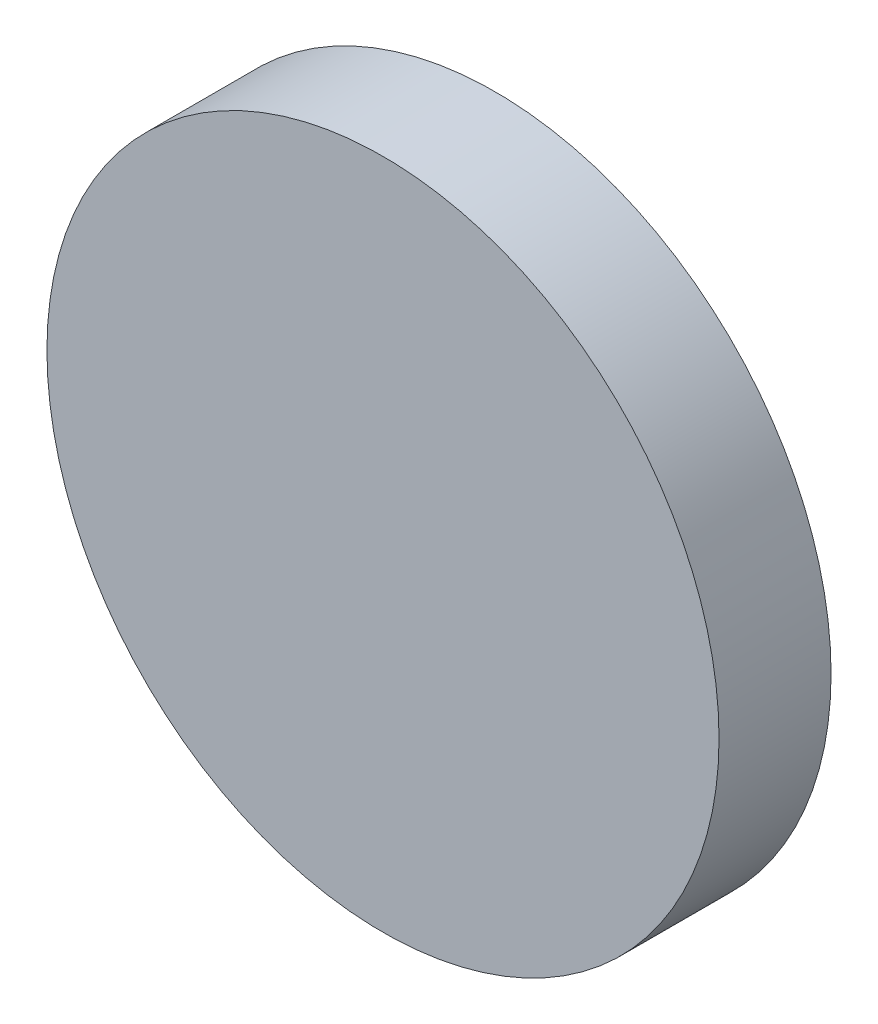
from build123d import *

# Parameters (mm, degrees)
SKETCH1_R      = 19.05
EXTRUDE1_DEPTH = 6.35


with BuildPart() as part:
    # Sketch1 → Extrude1 (new body)
    with BuildSketch(Plane.XY):
        Circle(SKETCH1_R)
    extrude(amount=EXTRUDE1_DEPTH)


solid = part.part
